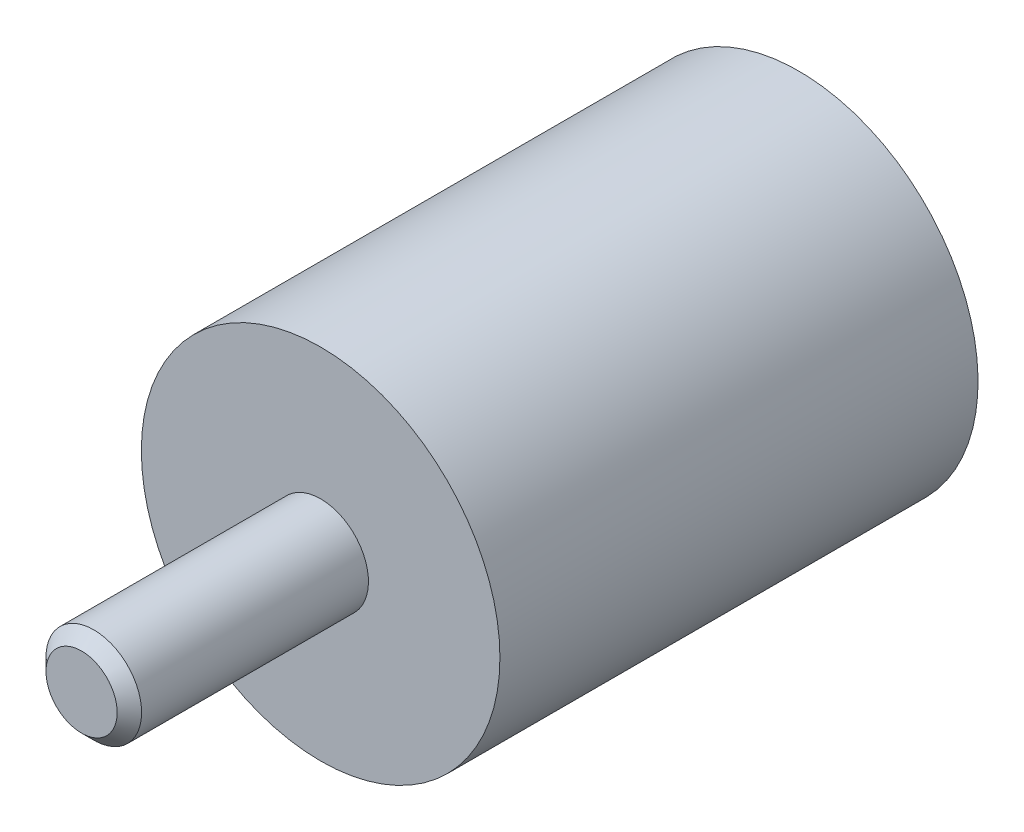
ISO-10303-21;
HEADER;
FILE_DESCRIPTION(('STEP AP214'),'2;1');
FILE_NAME('part.step','',(''),(''),'','','');
FILE_SCHEMA(('AUTOMOTIVE_DESIGN { 1 0 10303 214 1 1 1 1 }'));
ENDSEC;
DATA;
#1=APPLICATION_CONTEXT('core data for automotive mechanical design processes');
#2=APPLICATION_PROTOCOL_DEFINITION('international standard','automotive_design',2000,#1);
#3=PRODUCT_CONTEXT('',#1,'mechanical');
#4=PRODUCT('Part','Part','',(#3));
#5=PRODUCT_RELATED_PRODUCT_CATEGORY('part','',(#4));
#6=PRODUCT_DEFINITION_FORMATION('','',#4);
#7=PRODUCT_DEFINITION_CONTEXT('part definition',#1,'design');
#8=PRODUCT_DEFINITION('design','',#6,#7);
#9=PRODUCT_DEFINITION_SHAPE('','',#8);
#10=(LENGTH_UNIT() NAMED_UNIT(*) SI_UNIT(.MILLI.,.METRE.));
#11=(NAMED_UNIT(*) PLANE_ANGLE_UNIT() SI_UNIT($,.RADIAN.));
#12=(NAMED_UNIT(*) SI_UNIT($,.STERADIAN.) SOLID_ANGLE_UNIT());
#13=UNCERTAINTY_MEASURE_WITH_UNIT(LENGTH_MEASURE(1.E-05),#10,'distance_accuracy_value','');
#14=(GEOMETRIC_REPRESENTATION_CONTEXT(3) GLOBAL_UNCERTAINTY_ASSIGNED_CONTEXT((#13)) GLOBAL_UNIT_ASSIGNED_CONTEXT((#10,
#11,#12)) REPRESENTATION_CONTEXT('',''));
#15=CARTESIAN_POINT('',(0.,0.,0.));
#16=DIRECTION('',(0.,0.,1.));
#17=DIRECTION('',(1.,0.,0.));
#18=AXIS2_PLACEMENT_3D('',#15,#16,#17);
#19=CARTESIAN_POINT('',(7.5,0.,20.));
#20=DIRECTION('',(0.,0.,1.));
#21=DIRECTION('',(0.,-1.,0.));
#22=AXIS2_PLACEMENT_3D('',#19,#20,#21);
#23=PLANE('',#22);
#24=CARTESIAN_POINT('',(0.,0.,20.));
#25=DIRECTION('',(0.,0.,-1.));
#26=DIRECTION('',(0.,1.,0.));
#27=AXIS2_PLACEMENT_3D('',#24,#25,#26);
#28=CIRCLE('',#27,2.);
#29=CARTESIAN_POINT('',(0.,2.,20.));
#30=VERTEX_POINT('',#29);
#31=EDGE_CURVE('E23',#30,#30,#28,.T.);
#32=ORIENTED_EDGE('',*,*,#31,.T.);
#33=EDGE_LOOP('',(#32));
#34=FACE_BOUND('',#33,.T.);
#35=CARTESIAN_POINT('',(0.,0.,20.));
#36=DIRECTION('',(0.,0.,-1.));
#37=DIRECTION('',(0.,1.,0.));
#38=AXIS2_PLACEMENT_3D('',#35,#36,#37);
#39=CIRCLE('',#38,7.5);
#40=CARTESIAN_POINT('',(0.,7.5,20.));
#41=VERTEX_POINT('',#40);
#42=EDGE_CURVE('E19',#41,#41,#39,.T.);
#43=ORIENTED_EDGE('',*,*,#42,.F.);
#44=EDGE_LOOP('',(#43));
#45=FACE_BOUND('',#44,.T.);
#46=ADVANCED_FACE('F12',(#34,#45),#23,.T.);
#47=CARTESIAN_POINT('',(0.,0.,0.));
#48=DIRECTION('',(0.,0.,-1.));
#49=DIRECTION('',(0.,1.,0.));
#50=AXIS2_PLACEMENT_3D('',#47,#48,#49);
#51=CYLINDRICAL_SURFACE('',#50,2.);
#52=CARTESIAN_POINT('',(0.,0.,29.4889744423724));
#53=DIRECTION('',(0.,0.,-1.));
#54=DIRECTION('',(0.,1.,0.));
#55=AXIS2_PLACEMENT_3D('',#52,#53,#54);
#56=CIRCLE('',#55,2.);
#57=CARTESIAN_POINT('',(0.,2.,29.4889744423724));
#58=VERTEX_POINT('',#57);
#59=EDGE_CURVE('E27',#58,#58,#56,.T.);
#60=ORIENTED_EDGE('',*,*,#59,.T.);
#61=EDGE_LOOP('',(#60));
#62=FACE_BOUND('',#61,.T.);
#63=ORIENTED_EDGE('',*,*,#31,.F.);
#64=EDGE_LOOP('',(#63));
#65=FACE_BOUND('',#64,.T.);
#66=ADVANCED_FACE('F48',(#62,#65),#51,.T.);
#67=CARTESIAN_POINT('',(0.,0.,29.4889744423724));
#68=DIRECTION('',(0.,0.,-1.));
#69=DIRECTION('',(0.,1.,0.));
#70=AXIS2_PLACEMENT_3D('',#67,#68,#69);
#71=CONICAL_SURFACE('',#70,2.,0.785398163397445);
#72=CARTESIAN_POINT('',(0.,0.,30.));
#73=DIRECTION('',(0.,0.,-1.));
#74=DIRECTION('',(0.,1.,0.));
#75=AXIS2_PLACEMENT_3D('',#72,#73,#74);
#76=CIRCLE('',#75,1.48897444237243);
#77=CARTESIAN_POINT('',(0.,1.48897444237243,30.));
#78=VERTEX_POINT('',#77);
#79=EDGE_CURVE('E32',#78,#78,#76,.T.);
#80=ORIENTED_EDGE('',*,*,#79,.T.);
#81=EDGE_LOOP('',(#80));
#82=FACE_BOUND('',#81,.T.);
#83=ORIENTED_EDGE('',*,*,#59,.F.);
#84=EDGE_LOOP('',(#83));
#85=FACE_BOUND('',#84,.T.);
#86=ADVANCED_FACE('F36',(#82,#85),#71,.T.);
#87=CARTESIAN_POINT('',(1.48897444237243,0.,30.));
#88=DIRECTION('',(0.,0.,1.));
#89=DIRECTION('',(0.,-1.,0.));
#90=AXIS2_PLACEMENT_3D('',#87,#88,#89);
#91=PLANE('',#90);
#92=ORIENTED_EDGE('',*,*,#79,.F.);
#93=EDGE_LOOP('',(#92));
#94=FACE_BOUND('',#93,.T.);
#95=ADVANCED_FACE('F39',(#94),#91,.T.);
#96=CARTESIAN_POINT('',(0.,0.,0.));
#97=DIRECTION('',(0.,0.,1.));
#98=DIRECTION('',(0.,-1.,0.));
#99=AXIS2_PLACEMENT_3D('',#96,#97,#98);
#100=CYLINDRICAL_SURFACE('',#99,7.5);
#101=CARTESIAN_POINT('',(0.,0.,0.));
#102=DIRECTION('',(0.,0.,1.));
#103=DIRECTION('',(0.,-1.,0.));
#104=AXIS2_PLACEMENT_3D('',#101,#102,#103);
#105=CIRCLE('',#104,7.5);
#106=CARTESIAN_POINT('',(0.,-7.5,0.));
#107=VERTEX_POINT('',#106);
#108=EDGE_CURVE('E8',#107,#107,#105,.T.);
#109=ORIENTED_EDGE('',*,*,#108,.T.);
#110=EDGE_LOOP('',(#109));
#111=FACE_BOUND('',#110,.T.);
#112=ORIENTED_EDGE('',*,*,#42,.T.);
#113=EDGE_LOOP('',(#112));
#114=FACE_BOUND('',#113,.T.);
#115=ADVANCED_FACE('F14',(#111,#114),#100,.T.);
#116=CARTESIAN_POINT('',(7.5,0.,0.));
#117=DIRECTION('',(0.,0.,-1.));
#118=DIRECTION('',(0.,1.,0.));
#119=AXIS2_PLACEMENT_3D('',#116,#117,#118);
#120=PLANE('',#119);
#121=ORIENTED_EDGE('',*,*,#108,.F.);
#122=EDGE_LOOP('',(#121));
#123=FACE_BOUND('',#122,.T.);
#124=ADVANCED_FACE('F47',(#123),#120,.T.);
#125=CLOSED_SHELL('',(#46,#66,#86,#95,#115,#124));
#126=MANIFOLD_SOLID_BREP('B1',#125);
#127=ADVANCED_BREP_SHAPE_REPRESENTATION('',(#18,#126),#14);
#128=SHAPE_DEFINITION_REPRESENTATION(#9,#127);
ENDSEC;
END-ISO-10303-21;
